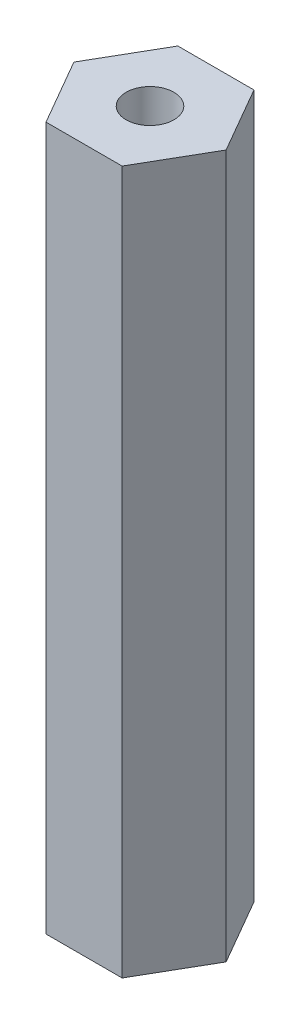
ISO-10303-21;
HEADER;
FILE_DESCRIPTION(('STEP AP214'),'2;1');
FILE_NAME('part.step','',(''),(''),'','','');
FILE_SCHEMA(('AUTOMOTIVE_DESIGN { 1 0 10303 214 1 1 1 1 }'));
ENDSEC;
DATA;
#1=APPLICATION_CONTEXT('core data for automotive mechanical design processes');
#2=APPLICATION_PROTOCOL_DEFINITION('international standard','automotive_design',2000,#1);
#3=PRODUCT_CONTEXT('',#1,'mechanical');
#4=PRODUCT('Part','Part','',(#3));
#5=PRODUCT_RELATED_PRODUCT_CATEGORY('part','',(#4));
#6=PRODUCT_DEFINITION_FORMATION('','',#4);
#7=PRODUCT_DEFINITION_CONTEXT('part definition',#1,'design');
#8=PRODUCT_DEFINITION('design','',#6,#7);
#9=PRODUCT_DEFINITION_SHAPE('','',#8);
#10=(LENGTH_UNIT() NAMED_UNIT(*) SI_UNIT(.MILLI.,.METRE.));
#11=(NAMED_UNIT(*) PLANE_ANGLE_UNIT() SI_UNIT($,.RADIAN.));
#12=(NAMED_UNIT(*) SI_UNIT($,.STERADIAN.) SOLID_ANGLE_UNIT());
#13=UNCERTAINTY_MEASURE_WITH_UNIT(LENGTH_MEASURE(1.E-05),#10,'distance_accuracy_value','');
#14=(GEOMETRIC_REPRESENTATION_CONTEXT(3) GLOBAL_UNCERTAINTY_ASSIGNED_CONTEXT((#13)) GLOBAL_UNIT_ASSIGNED_CONTEXT((#10,
#11,#12)) REPRESENTATION_CONTEXT('',''));
#15=CARTESIAN_POINT('',(0.,0.,0.));
#16=DIRECTION('',(0.,0.,1.));
#17=DIRECTION('',(1.,0.,0.));
#18=AXIS2_PLACEMENT_3D('',#15,#16,#17);
#19=CARTESIAN_POINT('',(2.74963065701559,50.8,4.7625));
#20=DIRECTION('',(-0.866025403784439,0.,-0.5));
#21=DIRECTION('',(-0.5,0.,0.866025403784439));
#22=AXIS2_PLACEMENT_3D('',#19,#20,#21);
#23=PLANE('',#22);
#24=DIRECTION('',(0.5,0.,-0.866025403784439));
#25=VECTOR('',#24,1.);
#26=CARTESIAN_POINT('',(2.74963065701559,0.,4.7625));
#27=LINE('',#26,#25);
#28=CARTESIAN_POINT('',(2.74963065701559,0.,4.7625));
#29=VERTEX_POINT('',#28);
#30=CARTESIAN_POINT('',(5.49926131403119,0.,0.));
#31=VERTEX_POINT('',#30);
#32=EDGE_CURVE('E115',#29,#31,#27,.T.);
#33=ORIENTED_EDGE('',*,*,#32,.T.);
#34=DIRECTION('',(0.,-1.,0.));
#35=VECTOR('',#34,1.);
#36=CARTESIAN_POINT('',(5.49926131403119,50.8,0.));
#37=LINE('',#36,#35);
#38=CARTESIAN_POINT('',(5.49926131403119,50.8,0.));
#39=VERTEX_POINT('',#38);
#40=EDGE_CURVE('E11',#39,#31,#37,.T.);
#41=ORIENTED_EDGE('',*,*,#40,.F.);
#42=DIRECTION('',(0.5,0.,-0.866025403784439));
#43=VECTOR('',#42,1.);
#44=CARTESIAN_POINT('',(2.74963065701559,50.8,4.7625));
#45=LINE('',#44,#43);
#46=CARTESIAN_POINT('',(2.74963065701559,50.8,4.7625));
#47=VERTEX_POINT('',#46);
#48=EDGE_CURVE('E128',#47,#39,#45,.T.);
#49=ORIENTED_EDGE('',*,*,#48,.F.);
#50=DIRECTION('',(0.,-1.,0.));
#51=VECTOR('',#50,1.);
#52=CARTESIAN_POINT('',(2.74963065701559,50.8,4.7625));
#53=LINE('',#52,#51);
#54=EDGE_CURVE('E138',#47,#29,#53,.T.);
#55=ORIENTED_EDGE('',*,*,#54,.T.);
#56=EDGE_LOOP('',(#33,#41,#49,#55));
#57=FACE_BOUND('',#56,.T.);
#58=ADVANCED_FACE('F38',(#57),#23,.F.);
#59=CARTESIAN_POINT('',(5.49926131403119,50.8,0.));
#60=DIRECTION('',(-0.866025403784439,0.,0.5));
#61=DIRECTION('',(0.5,0.,0.866025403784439));
#62=AXIS2_PLACEMENT_3D('',#59,#60,#61);
#63=PLANE('',#62);
#64=DIRECTION('',(-0.5,0.,-0.866025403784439));
#65=VECTOR('',#64,1.);
#66=CARTESIAN_POINT('',(5.49926131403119,0.,0.));
#67=LINE('',#66,#65);
#68=CARTESIAN_POINT('',(2.74963065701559,0.,-4.7625));
#69=VERTEX_POINT('',#68);
#70=EDGE_CURVE('E118',#31,#69,#67,.T.);
#71=ORIENTED_EDGE('',*,*,#70,.T.);
#72=DIRECTION('',(0.,-1.,0.));
#73=VECTOR('',#72,1.);
#74=CARTESIAN_POINT('',(2.74963065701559,50.8,-4.7625));
#75=LINE('',#74,#73);
#76=CARTESIAN_POINT('',(2.74963065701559,50.8,-4.7625));
#77=VERTEX_POINT('',#76);
#78=EDGE_CURVE('E45',#77,#69,#75,.T.);
#79=ORIENTED_EDGE('',*,*,#78,.F.);
#80=DIRECTION('',(-0.5,0.,-0.866025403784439));
#81=VECTOR('',#80,1.);
#82=CARTESIAN_POINT('',(5.49926131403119,50.8,0.));
#83=LINE('',#82,#81);
#84=EDGE_CURVE('E130',#39,#77,#83,.T.);
#85=ORIENTED_EDGE('',*,*,#84,.F.);
#86=ORIENTED_EDGE('',*,*,#40,.T.);
#87=EDGE_LOOP('',(#71,#79,#85,#86));
#88=FACE_BOUND('',#87,.T.);
#89=ADVANCED_FACE('F175',(#88),#63,.F.);
#90=CARTESIAN_POINT('',(2.74963065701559,50.8,-4.7625));
#91=DIRECTION('',(0.,0.,1.));
#92=DIRECTION('',(1.,0.,0.));
#93=AXIS2_PLACEMENT_3D('',#90,#91,#92);
#94=PLANE('',#93);
#95=DIRECTION('',(-1.,0.,0.));
#96=VECTOR('',#95,1.);
#97=CARTESIAN_POINT('',(2.74963065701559,0.,-4.7625));
#98=LINE('',#97,#96);
#99=CARTESIAN_POINT('',(-2.74963065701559,0.,-4.7625));
#100=VERTEX_POINT('',#99);
#101=EDGE_CURVE('E120',#69,#100,#98,.T.);
#102=ORIENTED_EDGE('',*,*,#101,.T.);
#103=DIRECTION('',(0.,-1.,0.));
#104=VECTOR('',#103,1.);
#105=CARTESIAN_POINT('',(-2.74963065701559,50.8,-4.7625));
#106=LINE('',#105,#104);
#107=CARTESIAN_POINT('',(-2.74963065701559,50.8,-4.7625));
#108=VERTEX_POINT('',#107);
#109=EDGE_CURVE('E147',#108,#100,#106,.T.);
#110=ORIENTED_EDGE('',*,*,#109,.F.);
#111=DIRECTION('',(-1.,0.,0.));
#112=VECTOR('',#111,1.);
#113=CARTESIAN_POINT('',(2.74963065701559,50.8,-4.7625));
#114=LINE('',#113,#112);
#115=EDGE_CURVE('E132',#77,#108,#114,.T.);
#116=ORIENTED_EDGE('',*,*,#115,.F.);
#117=ORIENTED_EDGE('',*,*,#78,.T.);
#118=EDGE_LOOP('',(#102,#110,#116,#117));
#119=FACE_BOUND('',#118,.T.);
#120=ADVANCED_FACE('F154',(#119),#94,.F.);
#121=CARTESIAN_POINT('',(-2.74963065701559,50.8,-4.7625));
#122=DIRECTION('',(0.866025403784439,0.,0.5));
#123=DIRECTION('',(0.5,0.,-0.866025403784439));
#124=AXIS2_PLACEMENT_3D('',#121,#122,#123);
#125=PLANE('',#124);
#126=DIRECTION('',(-0.5,0.,0.866025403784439));
#127=VECTOR('',#126,1.);
#128=CARTESIAN_POINT('',(-2.74963065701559,0.,-4.7625));
#129=LINE('',#128,#127);
#130=CARTESIAN_POINT('',(-5.49926131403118,0.,0.));
#131=VERTEX_POINT('',#130);
#132=EDGE_CURVE('E122',#100,#131,#129,.T.);
#133=ORIENTED_EDGE('',*,*,#132,.T.);
#134=DIRECTION('',(0.,-1.,0.));
#135=VECTOR('',#134,1.);
#136=CARTESIAN_POINT('',(-5.49926131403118,50.8,0.));
#137=LINE('',#136,#135);
#138=CARTESIAN_POINT('',(-5.49926131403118,50.8,0.));
#139=VERTEX_POINT('',#138);
#140=EDGE_CURVE('E144',#139,#131,#137,.T.);
#141=ORIENTED_EDGE('',*,*,#140,.F.);
#142=DIRECTION('',(-0.5,0.,0.866025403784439));
#143=VECTOR('',#142,1.);
#144=CARTESIAN_POINT('',(-2.74963065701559,50.8,-4.7625));
#145=LINE('',#144,#143);
#146=EDGE_CURVE('E134',#108,#139,#145,.T.);
#147=ORIENTED_EDGE('',*,*,#146,.F.);
#148=ORIENTED_EDGE('',*,*,#109,.T.);
#149=EDGE_LOOP('',(#133,#141,#147,#148));
#150=FACE_BOUND('',#149,.T.);
#151=ADVANCED_FACE('F165',(#150),#125,.F.);
#152=CARTESIAN_POINT('',(-5.49926131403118,50.8,0.));
#153=DIRECTION('',(0.866025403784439,0.,-0.5));
#154=DIRECTION('',(-0.5,0.,-0.866025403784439));
#155=AXIS2_PLACEMENT_3D('',#152,#153,#154);
#156=PLANE('',#155);
#157=DIRECTION('',(0.5,0.,0.866025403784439));
#158=VECTOR('',#157,1.);
#159=CARTESIAN_POINT('',(-5.49926131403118,0.,0.));
#160=LINE('',#159,#158);
#161=CARTESIAN_POINT('',(-2.74963065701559,0.,4.7625));
#162=VERTEX_POINT('',#161);
#163=EDGE_CURVE('E124',#131,#162,#160,.T.);
#164=ORIENTED_EDGE('',*,*,#163,.T.);
#165=DIRECTION('',(0.,-1.,0.));
#166=VECTOR('',#165,1.);
#167=CARTESIAN_POINT('',(-2.74963065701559,50.8,4.7625));
#168=LINE('',#167,#166);
#169=CARTESIAN_POINT('',(-2.74963065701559,50.8,4.7625));
#170=VERTEX_POINT('',#169);
#171=EDGE_CURVE('E141',#170,#162,#168,.T.);
#172=ORIENTED_EDGE('',*,*,#171,.F.);
#173=DIRECTION('',(0.5,0.,0.866025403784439));
#174=VECTOR('',#173,1.);
#175=CARTESIAN_POINT('',(-5.49926131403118,50.8,0.));
#176=LINE('',#175,#174);
#177=EDGE_CURVE('E57',#139,#170,#176,.T.);
#178=ORIENTED_EDGE('',*,*,#177,.F.);
#179=ORIENTED_EDGE('',*,*,#140,.T.);
#180=EDGE_LOOP('',(#164,#172,#178,#179));
#181=FACE_BOUND('',#180,.T.);
#182=ADVANCED_FACE('F168',(#181),#156,.F.);
#183=CARTESIAN_POINT('',(-2.74963065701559,50.8,4.7625));
#184=DIRECTION('',(0.,0.,-1.));
#185=DIRECTION('',(-1.,0.,0.));
#186=AXIS2_PLACEMENT_3D('',#183,#184,#185);
#187=PLANE('',#186);
#188=DIRECTION('',(1.,0.,0.));
#189=VECTOR('',#188,1.);
#190=CARTESIAN_POINT('',(-2.74963065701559,0.,4.7625));
#191=LINE('',#190,#189);
#192=EDGE_CURVE('E126',#162,#29,#191,.T.);
#193=ORIENTED_EDGE('',*,*,#192,.T.);
#194=ORIENTED_EDGE('',*,*,#54,.F.);
#195=DIRECTION('',(1.,0.,0.));
#196=VECTOR('',#195,1.);
#197=CARTESIAN_POINT('',(-2.74963065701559,50.8,4.7625));
#198=LINE('',#197,#196);
#199=EDGE_CURVE('E52',#170,#47,#198,.T.);
#200=ORIENTED_EDGE('',*,*,#199,.F.);
#201=ORIENTED_EDGE('',*,*,#171,.T.);
#202=EDGE_LOOP('',(#193,#194,#200,#201));
#203=FACE_BOUND('',#202,.T.);
#204=ADVANCED_FACE('F170',(#203),#187,.F.);
#205=CARTESIAN_POINT('',(8.24889197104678,50.8,-4.7625));
#206=DIRECTION('',(0.,1.,0.));
#207=DIRECTION('',(0.,0.,1.));
#208=AXIS2_PLACEMENT_3D('',#205,#206,#207);
#209=PLANE('',#208);
#210=CARTESIAN_POINT('',(0.,50.8,0.));
#211=DIRECTION('',(0.,1.,0.));
#212=DIRECTION('',(0.,0.,1.));
#213=AXIS2_PLACEMENT_3D('',#210,#211,#212);
#214=CIRCLE('',#213,1.7272);
#215=CARTESIAN_POINT('',(0.,50.8,1.7272));
#216=VERTEX_POINT('',#215);
#217=EDGE_CURVE('E108',#216,#216,#214,.T.);
#218=ORIENTED_EDGE('',*,*,#217,.F.);
#219=EDGE_LOOP('',(#218));
#220=FACE_BOUND('',#219,.T.);
#221=ORIENTED_EDGE('',*,*,#48,.T.);
#222=ORIENTED_EDGE('',*,*,#84,.T.);
#223=ORIENTED_EDGE('',*,*,#115,.T.);
#224=ORIENTED_EDGE('',*,*,#146,.T.);
#225=ORIENTED_EDGE('',*,*,#177,.T.);
#226=ORIENTED_EDGE('',*,*,#199,.T.);
#227=EDGE_LOOP('',(#221,#222,#223,#224,#225,#226));
#228=FACE_BOUND('',#227,.T.);
#229=ADVANCED_FACE('F174',(#220,#228),#209,.T.);
#230=CARTESIAN_POINT('',(8.24889197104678,0.,-4.7625));
#231=DIRECTION('',(0.,1.,0.));
#232=DIRECTION('',(0.,0.,1.));
#233=AXIS2_PLACEMENT_3D('',#230,#231,#232);
#234=PLANE('',#233);
#235=CARTESIAN_POINT('',(0.,0.,0.));
#236=DIRECTION('',(0.,-1.,0.));
#237=DIRECTION('',(0.,0.,-1.));
#238=AXIS2_PLACEMENT_3D('',#235,#236,#237);
#239=CIRCLE('',#238,1.72719999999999);
#240=CARTESIAN_POINT('',(0.,0.,-1.72719999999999));
#241=VERTEX_POINT('',#240);
#242=EDGE_CURVE('E105',#241,#241,#239,.T.);
#243=ORIENTED_EDGE('',*,*,#242,.F.);
#244=EDGE_LOOP('',(#243));
#245=FACE_BOUND('',#244,.T.);
#246=ORIENTED_EDGE('',*,*,#32,.F.);
#247=ORIENTED_EDGE('',*,*,#192,.F.);
#248=ORIENTED_EDGE('',*,*,#163,.F.);
#249=ORIENTED_EDGE('',*,*,#132,.F.);
#250=ORIENTED_EDGE('',*,*,#101,.F.);
#251=ORIENTED_EDGE('',*,*,#70,.F.);
#252=EDGE_LOOP('',(#246,#247,#248,#249,#250,#251));
#253=FACE_BOUND('',#252,.T.);
#254=ADVANCED_FACE('F160',(#245,#253),#234,.F.);
#255=CARTESIAN_POINT('',(0.,50.8,0.));
#256=DIRECTION('',(0.,1.,0.));
#257=DIRECTION('',(0.,0.,1.));
#258=AXIS2_PLACEMENT_3D('',#255,#256,#257);
#259=CYLINDRICAL_SURFACE('',#258,1.7272);
#260=CARTESIAN_POINT('',(0.,36.9316,0.));
#261=DIRECTION('',(0.,1.,0.));
#262=DIRECTION('',(0.,0.,1.));
#263=AXIS2_PLACEMENT_3D('',#260,#261,#262);
#264=CIRCLE('',#263,1.7272);
#265=CARTESIAN_POINT('',(0.,36.9316,1.7272));
#266=VERTEX_POINT('',#265);
#267=EDGE_CURVE('E104',#266,#266,#264,.T.);
#268=ORIENTED_EDGE('',*,*,#267,.F.);
#269=EDGE_LOOP('',(#268));
#270=FACE_BOUND('',#269,.T.);
#271=ORIENTED_EDGE('',*,*,#217,.T.);
#272=EDGE_LOOP('',(#271));
#273=FACE_BOUND('',#272,.T.);
#274=ADVANCED_FACE('F194',(#270,#273),#259,.F.);
#275=CARTESIAN_POINT('',(0.,36.9316,0.));
#276=DIRECTION('',(0.,1.,0.));
#277=DIRECTION('',(0.,0.,1.));
#278=AXIS2_PLACEMENT_3D('',#275,#276,#277);
#279=CONICAL_SURFACE('',#278,1.7272,1.02974425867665);
#280=CARTESIAN_POINT('',(0.,35.8937935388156,0.));
#281=VERTEX_POINT('',#280);
#282=VERTEX_LOOP('',#281);
#283=FACE_BOUND('',#282,.T.);
#284=ORIENTED_EDGE('',*,*,#267,.T.);
#285=EDGE_LOOP('',(#284));
#286=FACE_BOUND('',#285,.T.);
#287=ADVANCED_FACE('F98',(#283,#286),#279,.F.);
#288=CARTESIAN_POINT('',(0.,13.8684,0.));
#289=DIRECTION('',(0.,-1.,0.));
#290=DIRECTION('',(0.,0.,-1.));
#291=AXIS2_PLACEMENT_3D('',#288,#289,#290);
#292=CONICAL_SURFACE('',#291,1.72719999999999,1.02974425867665);
#293=CARTESIAN_POINT('',(0.,14.9062064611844,0.));
#294=VERTEX_POINT('',#293);
#295=VERTEX_LOOP('',#294);
#296=FACE_BOUND('',#295,.T.);
#297=CARTESIAN_POINT('',(0.,13.8684,0.));
#298=DIRECTION('',(0.,-1.,0.));
#299=DIRECTION('',(0.,0.,-1.));
#300=AXIS2_PLACEMENT_3D('',#297,#298,#299);
#301=CIRCLE('',#300,1.72719999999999);
#302=CARTESIAN_POINT('',(0.,13.8684,-1.72719999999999));
#303=VERTEX_POINT('',#302);
#304=EDGE_CURVE('E102',#303,#303,#301,.T.);
#305=ORIENTED_EDGE('',*,*,#304,.T.);
#306=EDGE_LOOP('',(#305));
#307=FACE_BOUND('',#306,.T.);
#308=ADVANCED_FACE('F94',(#296,#307),#292,.F.);
#309=CARTESIAN_POINT('',(0.,0.,0.));
#310=DIRECTION('',(0.,-1.,0.));
#311=DIRECTION('',(0.,0.,-1.));
#312=AXIS2_PLACEMENT_3D('',#309,#310,#311);
#313=CYLINDRICAL_SURFACE('',#312,1.72719999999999);
#314=ORIENTED_EDGE('',*,*,#304,.F.);
#315=EDGE_LOOP('',(#314));
#316=FACE_BOUND('',#315,.T.);
#317=ORIENTED_EDGE('',*,*,#242,.T.);
#318=EDGE_LOOP('',(#317));
#319=FACE_BOUND('',#318,.T.);
#320=ADVANCED_FACE('F97',(#316,#319),#313,.F.);
#321=CLOSED_SHELL('',(#58,#89,#120,#151,#182,#204,#229,#254,#274,#287,#308,#320));
#322=MANIFOLD_SOLID_BREP('B2',#321);
#323=ADVANCED_BREP_SHAPE_REPRESENTATION('',(#18,#322),#14);
#324=SHAPE_DEFINITION_REPRESENTATION(#9,#323);
ENDSEC;
END-ISO-10303-21;
